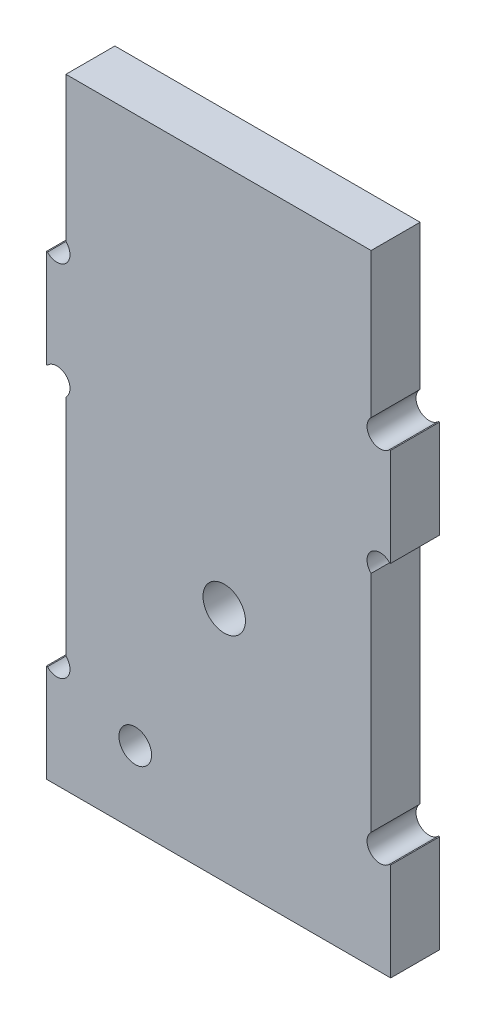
ISO-10303-21;
HEADER;
FILE_DESCRIPTION(('STEP AP214'),'2;1');
FILE_NAME('part.step','',(''),(''),'','','');
FILE_SCHEMA(('AUTOMOTIVE_DESIGN { 1 0 10303 214 1 1 1 1 }'));
ENDSEC;
DATA;
#1=APPLICATION_CONTEXT('core data for automotive mechanical design processes');
#2=APPLICATION_PROTOCOL_DEFINITION('international standard','automotive_design',2000,#1);
#3=PRODUCT_CONTEXT('',#1,'mechanical');
#4=PRODUCT('Part','Part','',(#3));
#5=PRODUCT_RELATED_PRODUCT_CATEGORY('part','',(#4));
#6=PRODUCT_DEFINITION_FORMATION('','',#4);
#7=PRODUCT_DEFINITION_CONTEXT('part definition',#1,'design');
#8=PRODUCT_DEFINITION('design','',#6,#7);
#9=PRODUCT_DEFINITION_SHAPE('','',#8);
#10=(LENGTH_UNIT() NAMED_UNIT(*) SI_UNIT(.MILLI.,.METRE.));
#11=(NAMED_UNIT(*) PLANE_ANGLE_UNIT() SI_UNIT($,.RADIAN.));
#12=(NAMED_UNIT(*) SI_UNIT($,.STERADIAN.) SOLID_ANGLE_UNIT());
#13=UNCERTAINTY_MEASURE_WITH_UNIT(LENGTH_MEASURE(1.E-05),#10,'distance_accuracy_value','');
#14=(GEOMETRIC_REPRESENTATION_CONTEXT(3) GLOBAL_UNCERTAINTY_ASSIGNED_CONTEXT((#13)) GLOBAL_UNIT_ASSIGNED_CONTEXT((#10,
#11,#12)) REPRESENTATION_CONTEXT('',''));
#15=CARTESIAN_POINT('',(0.,0.,0.));
#16=DIRECTION('',(0.,0.,1.));
#17=DIRECTION('',(1.,0.,0.));
#18=AXIS2_PLACEMENT_3D('',#15,#16,#17);
#19=CARTESIAN_POINT('',(-24.7,27.,6.));
#20=DIRECTION('',(0.,-1.,0.));
#21=DIRECTION('',(1.,0.,0.));
#22=AXIS2_PLACEMENT_3D('',#19,#20,#21);
#23=PLANE('',#22);
#24=DIRECTION('',(-1.,0.,0.));
#25=VECTOR('',#24,1.);
#26=CARTESIAN_POINT('',(-24.7,27.,0.));
#27=LINE('',#26,#25);
#28=CARTESIAN_POINT('',(-20.9618950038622,27.,0.));
#29=VERTEX_POINT('',#28);
#30=CARTESIAN_POINT('',(-21.1,27.,0.));
#31=VERTEX_POINT('',#30);
#32=EDGE_CURVE('E249',#29,#31,#27,.T.);
#33=ORIENTED_EDGE('',*,*,#32,.T.);
#34=DIRECTION('',(0.,0.,1.));
#35=VECTOR('',#34,1.);
#36=CARTESIAN_POINT('',(-21.1,27.,6.));
#37=LINE('',#36,#35);
#38=CARTESIAN_POINT('',(-21.1,27.,6.));
#39=VERTEX_POINT('',#38);
#40=EDGE_CURVE('E49',#31,#39,#37,.T.);
#41=ORIENTED_EDGE('',*,*,#40,.T.);
#42=DIRECTION('',(-1.,0.,0.));
#43=VECTOR('',#42,1.);
#44=CARTESIAN_POINT('',(-24.7,27.,6.));
#45=LINE('',#44,#43);
#46=CARTESIAN_POINT('',(-20.9618950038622,27.,6.));
#47=VERTEX_POINT('',#46);
#48=EDGE_CURVE('E220',#47,#39,#45,.T.);
#49=ORIENTED_EDGE('',*,*,#48,.F.);
#50=DIRECTION('',(0.,0.,1.));
#51=VECTOR('',#50,1.);
#52=CARTESIAN_POINT('',(-20.9618950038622,27.,0.));
#53=LINE('',#52,#51);
#54=EDGE_CURVE('E349',#47,#29,#53,.F.);
#55=ORIENTED_EDGE('',*,*,#54,.T.);
#56=EDGE_LOOP('',(#33,#41,#49,#55));
#57=FACE_BOUND('',#56,.T.);
#58=ADVANCED_FACE('F35',(#57),#23,.F.);
#59=CARTESIAN_POINT('',(-24.7,15.,6.));
#60=DIRECTION('',(0.,1.,0.));
#61=DIRECTION('',(0.,0.,1.));
#62=AXIS2_PLACEMENT_3D('',#59,#60,#61);
#63=PLANE('',#62);
#64=DIRECTION('',(1.,0.,0.));
#65=VECTOR('',#64,1.);
#66=CARTESIAN_POINT('',(-24.7,15.,6.));
#67=LINE('',#66,#65);
#68=CARTESIAN_POINT('',(-21.1,15.,6.));
#69=VERTEX_POINT('',#68);
#70=CARTESIAN_POINT('',(-20.9618950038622,15.,6.));
#71=VERTEX_POINT('',#70);
#72=EDGE_CURVE('E252',#69,#71,#67,.T.);
#73=ORIENTED_EDGE('',*,*,#72,.F.);
#74=DIRECTION('',(0.,0.,-1.));
#75=VECTOR('',#74,1.);
#76=CARTESIAN_POINT('',(-21.1,15.,6.));
#77=LINE('',#76,#75);
#78=CARTESIAN_POINT('',(-21.1,15.,0.));
#79=VERTEX_POINT('',#78);
#80=EDGE_CURVE('E316',#69,#79,#77,.T.);
#81=ORIENTED_EDGE('',*,*,#80,.T.);
#82=DIRECTION('',(1.,0.,0.));
#83=VECTOR('',#82,1.);
#84=CARTESIAN_POINT('',(-24.7,15.,0.));
#85=LINE('',#84,#83);
#86=CARTESIAN_POINT('',(-20.9618950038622,15.,0.));
#87=VERTEX_POINT('',#86);
#88=EDGE_CURVE('E224',#79,#87,#85,.T.);
#89=ORIENTED_EDGE('',*,*,#88,.T.);
#90=DIRECTION('',(0.,0.,-1.));
#91=VECTOR('',#90,1.);
#92=CARTESIAN_POINT('',(-20.9618950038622,15.,6.));
#93=LINE('',#92,#91);
#94=EDGE_CURVE('E273',#71,#87,#93,.T.);
#95=ORIENTED_EDGE('',*,*,#94,.F.);
#96=EDGE_LOOP('',(#73,#81,#89,#95));
#97=FACE_BOUND('',#96,.T.);
#98=ADVANCED_FACE('F37',(#97),#63,.F.);
#99=CARTESIAN_POINT('',(-19.8,13.9,6.));
#100=DIRECTION('',(0.,0.,-1.));
#101=DIRECTION('',(-1.,0.,0.));
#102=AXIS2_PLACEMENT_3D('',#99,#100,#101);
#103=CYLINDRICAL_SURFACE('',#102,1.60000000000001);
#104=CARTESIAN_POINT('',(-19.8,13.9,0.));
#105=DIRECTION('',(0.,0.,-1.));
#106=DIRECTION('',(-1.,0.,0.));
#107=AXIS2_PLACEMENT_3D('',#104,#105,#106);
#108=CIRCLE('',#107,1.60000000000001);
#109=CARTESIAN_POINT('',(-18.7,12.7381049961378,0.));
#110=VERTEX_POINT('',#109);
#111=EDGE_CURVE('E226',#87,#110,#108,.T.);
#112=ORIENTED_EDGE('',*,*,#111,.T.);
#113=DIRECTION('',(0.,0.,-1.));
#114=VECTOR('',#113,1.);
#115=CARTESIAN_POINT('',(-18.7,12.7381049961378,6.));
#116=LINE('',#115,#114);
#117=CARTESIAN_POINT('',(-18.7,12.7381049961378,6.));
#118=VERTEX_POINT('',#117);
#119=EDGE_CURVE('E270',#118,#110,#116,.T.);
#120=ORIENTED_EDGE('',*,*,#119,.F.);
#121=CARTESIAN_POINT('',(-19.8,13.9,6.));
#122=DIRECTION('',(0.,0.,-1.));
#123=DIRECTION('',(-1.,0.,0.));
#124=AXIS2_PLACEMENT_3D('',#121,#122,#123);
#125=CIRCLE('',#124,1.60000000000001);
#126=EDGE_CURVE('E374',#71,#118,#125,.T.);
#127=ORIENTED_EDGE('',*,*,#126,.F.);
#128=ORIENTED_EDGE('',*,*,#94,.T.);
#129=EDGE_LOOP('',(#112,#120,#127,#128));
#130=FACE_BOUND('',#129,.T.);
#131=ADVANCED_FACE('F443',(#130),#103,.F.);
#132=CARTESIAN_POINT('',(-18.7,12.7381049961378,6.));
#133=DIRECTION('',(1.,0.,0.));
#134=DIRECTION('',(0.,1.,0.));
#135=AXIS2_PLACEMENT_3D('',#132,#133,#134);
#136=PLANE('',#135);
#137=DIRECTION('',(0.,-1.,0.));
#138=VECTOR('',#137,1.);
#139=CARTESIAN_POINT('',(-18.7,12.7381049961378,0.));
#140=LINE('',#139,#138);
#141=CARTESIAN_POINT('',(-18.7,-14.7381049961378,0.));
#142=VERTEX_POINT('',#141);
#143=EDGE_CURVE('E229',#110,#142,#140,.T.);
#144=ORIENTED_EDGE('',*,*,#143,.T.);
#145=DIRECTION('',(0.,0.,-1.));
#146=VECTOR('',#145,1.);
#147=CARTESIAN_POINT('',(-18.7,-14.7381049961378,6.));
#148=LINE('',#147,#146);
#149=CARTESIAN_POINT('',(-18.7,-14.7381049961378,6.));
#150=VERTEX_POINT('',#149);
#151=EDGE_CURVE('E267',#150,#142,#148,.T.);
#152=ORIENTED_EDGE('',*,*,#151,.F.);
#153=DIRECTION('',(0.,-1.,0.));
#154=VECTOR('',#153,1.);
#155=CARTESIAN_POINT('',(-18.7,12.7381049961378,6.));
#156=LINE('',#155,#154);
#157=EDGE_CURVE('E376',#118,#150,#156,.T.);
#158=ORIENTED_EDGE('',*,*,#157,.F.);
#159=ORIENTED_EDGE('',*,*,#119,.T.);
#160=EDGE_LOOP('',(#144,#152,#158,#159));
#161=FACE_BOUND('',#160,.T.);
#162=ADVANCED_FACE('F593',(#161),#136,.F.);
#163=CARTESIAN_POINT('',(-19.8,-15.9,6.));
#164=DIRECTION('',(0.,0.,-1.));
#165=DIRECTION('',(-1.,0.,0.));
#166=AXIS2_PLACEMENT_3D('',#163,#164,#165);
#167=CYLINDRICAL_SURFACE('',#166,1.6);
#168=CARTESIAN_POINT('',(-19.8,-15.9,0.));
#169=DIRECTION('',(0.,0.,-1.));
#170=DIRECTION('',(-1.,0.,0.));
#171=AXIS2_PLACEMENT_3D('',#168,#169,#170);
#172=CIRCLE('',#171,1.6);
#173=CARTESIAN_POINT('',(-20.9618950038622,-17.,0.));
#174=VERTEX_POINT('',#173);
#175=EDGE_CURVE('E231',#142,#174,#172,.T.);
#176=ORIENTED_EDGE('',*,*,#175,.T.);
#177=DIRECTION('',(0.,0.,-1.));
#178=VECTOR('',#177,1.);
#179=CARTESIAN_POINT('',(-20.9618950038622,-17.,6.));
#180=LINE('',#179,#178);
#181=CARTESIAN_POINT('',(-20.9618950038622,-17.,6.));
#182=VERTEX_POINT('',#181);
#183=EDGE_CURVE('E264',#182,#174,#180,.T.);
#184=ORIENTED_EDGE('',*,*,#183,.F.);
#185=CARTESIAN_POINT('',(-19.8,-15.9,6.));
#186=DIRECTION('',(0.,0.,-1.));
#187=DIRECTION('',(-1.,0.,0.));
#188=AXIS2_PLACEMENT_3D('',#185,#186,#187);
#189=CIRCLE('',#188,1.6);
#190=EDGE_CURVE('E208',#150,#182,#189,.T.);
#191=ORIENTED_EDGE('',*,*,#190,.F.);
#192=ORIENTED_EDGE('',*,*,#151,.T.);
#193=EDGE_LOOP('',(#176,#184,#191,#192));
#194=FACE_BOUND('',#193,.T.);
#195=ADVANCED_FACE('F382',(#194),#167,.F.);
#196=CARTESIAN_POINT('',(-20.9618950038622,-17.,6.));
#197=DIRECTION('',(0.,-1.,0.));
#198=DIRECTION('',(1.,0.,0.));
#199=AXIS2_PLACEMENT_3D('',#196,#197,#198);
#200=PLANE('',#199);
#201=DIRECTION('',(-1.,0.,0.));
#202=VECTOR('',#201,1.);
#203=CARTESIAN_POINT('',(-20.9618950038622,-17.,0.));
#204=LINE('',#203,#202);
#205=CARTESIAN_POINT('',(-21.1,-17.,0.));
#206=VERTEX_POINT('',#205);
#207=EDGE_CURVE('E233',#174,#206,#204,.T.);
#208=ORIENTED_EDGE('',*,*,#207,.T.);
#209=DIRECTION('',(0.,0.,1.));
#210=VECTOR('',#209,1.);
#211=CARTESIAN_POINT('',(-21.1,-17.,6.));
#212=LINE('',#211,#210);
#213=CARTESIAN_POINT('',(-21.1,-17.,6.));
#214=VERTEX_POINT('',#213);
#215=EDGE_CURVE('E57',#206,#214,#212,.T.);
#216=ORIENTED_EDGE('',*,*,#215,.T.);
#217=DIRECTION('',(-1.,0.,0.));
#218=VECTOR('',#217,1.);
#219=CARTESIAN_POINT('',(-20.9618950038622,-17.,6.));
#220=LINE('',#219,#218);
#221=EDGE_CURVE('E197',#182,#214,#220,.T.);
#222=ORIENTED_EDGE('',*,*,#221,.F.);
#223=ORIENTED_EDGE('',*,*,#183,.T.);
#224=EDGE_LOOP('',(#208,#216,#222,#223));
#225=FACE_BOUND('',#224,.T.);
#226=ADVANCED_FACE('F386',(#225),#200,.F.);
#227=CARTESIAN_POINT('',(24.7,-29.,6.));
#228=DIRECTION('',(0.,1.,0.));
#229=DIRECTION('',(-1.,0.,0.));
#230=AXIS2_PLACEMENT_3D('',#227,#228,#229);
#231=PLANE('',#230);
#232=DIRECTION('',(1.,0.,0.));
#233=VECTOR('',#232,1.);
#234=CARTESIAN_POINT('',(24.7,-29.,6.));
#235=LINE('',#234,#233);
#236=CARTESIAN_POINT('',(-21.1,-29.,6.));
#237=VERTEX_POINT('',#236);
#238=CARTESIAN_POINT('',(21.1,-29.,6.));
#239=VERTEX_POINT('',#238);
#240=EDGE_CURVE('E194',#237,#239,#235,.T.);
#241=ORIENTED_EDGE('',*,*,#240,.F.);
#242=DIRECTION('',(0.,0.,-1.));
#243=VECTOR('',#242,1.);
#244=CARTESIAN_POINT('',(-21.1,-29.,6.));
#245=LINE('',#244,#243);
#246=CARTESIAN_POINT('',(-21.1,-29.,0.));
#247=VERTEX_POINT('',#246);
#248=EDGE_CURVE('E181',#237,#247,#245,.T.);
#249=ORIENTED_EDGE('',*,*,#248,.T.);
#250=DIRECTION('',(1.,0.,0.));
#251=VECTOR('',#250,1.);
#252=CARTESIAN_POINT('',(24.7,-29.,0.));
#253=LINE('',#252,#251);
#254=CARTESIAN_POINT('',(21.1,-29.,0.));
#255=VERTEX_POINT('',#254);
#256=EDGE_CURVE('E236',#247,#255,#253,.T.);
#257=ORIENTED_EDGE('',*,*,#256,.T.);
#258=DIRECTION('',(0.,0.,1.));
#259=VECTOR('',#258,1.);
#260=CARTESIAN_POINT('',(21.1,-29.,6.));
#261=LINE('',#260,#259);
#262=EDGE_CURVE('E203',#255,#239,#261,.T.);
#263=ORIENTED_EDGE('',*,*,#262,.T.);
#264=EDGE_LOOP('',(#241,#249,#257,#263));
#265=FACE_BOUND('',#264,.T.);
#266=ADVANCED_FACE('F201',(#265),#231,.F.);
#267=CARTESIAN_POINT('',(20.9618950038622,-17.,6.));
#268=DIRECTION('',(0.,-1.,0.));
#269=DIRECTION('',(0.,0.,-1.));
#270=AXIS2_PLACEMENT_3D('',#267,#268,#269);
#271=PLANE('',#270);
#272=DIRECTION('',(-1.,0.,0.));
#273=VECTOR('',#272,1.);
#274=CARTESIAN_POINT('',(20.9618950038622,-17.,6.));
#275=LINE('',#274,#273);
#276=CARTESIAN_POINT('',(21.1,-17.,6.));
#277=VERTEX_POINT('',#276);
#278=CARTESIAN_POINT('',(20.9618950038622,-17.,6.));
#279=VERTEX_POINT('',#278);
#280=EDGE_CURVE('E204',#277,#279,#275,.T.);
#281=ORIENTED_EDGE('',*,*,#280,.F.);
#282=DIRECTION('',(0.,0.,-1.));
#283=VECTOR('',#282,1.);
#284=CARTESIAN_POINT('',(21.1,-17.,6.));
#285=LINE('',#284,#283);
#286=CARTESIAN_POINT('',(21.1,-17.,0.));
#287=VERTEX_POINT('',#286);
#288=EDGE_CURVE('E288',#277,#287,#285,.T.);
#289=ORIENTED_EDGE('',*,*,#288,.T.);
#290=DIRECTION('',(-1.,0.,0.));
#291=VECTOR('',#290,1.);
#292=CARTESIAN_POINT('',(20.9618950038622,-17.,0.));
#293=LINE('',#292,#291);
#294=CARTESIAN_POINT('',(20.9618950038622,-17.,0.));
#295=VERTEX_POINT('',#294);
#296=EDGE_CURVE('E238',#287,#295,#293,.T.);
#297=ORIENTED_EDGE('',*,*,#296,.T.);
#298=DIRECTION('',(0.,0.,-1.));
#299=VECTOR('',#298,1.);
#300=CARTESIAN_POINT('',(20.9618950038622,-17.,6.));
#301=LINE('',#300,#299);
#302=EDGE_CURVE('E261',#279,#295,#301,.T.);
#303=ORIENTED_EDGE('',*,*,#302,.F.);
#304=EDGE_LOOP('',(#281,#289,#297,#303));
#305=FACE_BOUND('',#304,.T.);
#306=ADVANCED_FACE('F293',(#305),#271,.F.);
#307=CARTESIAN_POINT('',(19.8,-15.9,6.));
#308=DIRECTION('',(0.,0.,-1.));
#309=DIRECTION('',(-1.,0.,0.));
#310=AXIS2_PLACEMENT_3D('',#307,#308,#309);
#311=CYLINDRICAL_SURFACE('',#310,1.6);
#312=CARTESIAN_POINT('',(19.8,-15.9,0.));
#313=DIRECTION('',(0.,0.,-1.));
#314=DIRECTION('',(1.,0.,0.));
#315=AXIS2_PLACEMENT_3D('',#312,#313,#314);
#316=CIRCLE('',#315,1.6);
#317=CARTESIAN_POINT('',(18.7,-14.7381049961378,0.));
#318=VERTEX_POINT('',#317);
#319=EDGE_CURVE('E240',#295,#318,#316,.T.);
#320=ORIENTED_EDGE('',*,*,#319,.T.);
#321=DIRECTION('',(0.,0.,-1.));
#322=VECTOR('',#321,1.);
#323=CARTESIAN_POINT('',(18.7,-14.7381049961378,6.));
#324=LINE('',#323,#322);
#325=CARTESIAN_POINT('',(18.7,-14.7381049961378,6.));
#326=VERTEX_POINT('',#325);
#327=EDGE_CURVE('E258',#326,#318,#324,.T.);
#328=ORIENTED_EDGE('',*,*,#327,.F.);
#329=CARTESIAN_POINT('',(19.8,-15.9,6.));
#330=DIRECTION('',(0.,0.,-1.));
#331=DIRECTION('',(1.,0.,0.));
#332=AXIS2_PLACEMENT_3D('',#329,#330,#331);
#333=CIRCLE('',#332,1.6);
#334=EDGE_CURVE('E206',#279,#326,#333,.T.);
#335=ORIENTED_EDGE('',*,*,#334,.F.);
#336=ORIENTED_EDGE('',*,*,#302,.T.);
#337=EDGE_LOOP('',(#320,#328,#335,#336));
#338=FACE_BOUND('',#337,.T.);
#339=ADVANCED_FACE('F304',(#338),#311,.F.);
#340=CARTESIAN_POINT('',(18.7,12.7381049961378,6.));
#341=DIRECTION('',(-1.,0.,0.));
#342=DIRECTION('',(0.,-1.,0.));
#343=AXIS2_PLACEMENT_3D('',#340,#341,#342);
#344=PLANE('',#343);
#345=DIRECTION('',(0.,1.,0.));
#346=VECTOR('',#345,1.);
#347=CARTESIAN_POINT('',(18.7,12.7381049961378,0.));
#348=LINE('',#347,#346);
#349=CARTESIAN_POINT('',(18.7,12.7381049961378,0.));
#350=VERTEX_POINT('',#349);
#351=EDGE_CURVE('E242',#318,#350,#348,.T.);
#352=ORIENTED_EDGE('',*,*,#351,.T.);
#353=DIRECTION('',(0.,0.,-1.));
#354=VECTOR('',#353,1.);
#355=CARTESIAN_POINT('',(18.7,12.7381049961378,6.));
#356=LINE('',#355,#354);
#357=CARTESIAN_POINT('',(18.7,12.7381049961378,6.));
#358=VERTEX_POINT('',#357);
#359=EDGE_CURVE('E255',#358,#350,#356,.T.);
#360=ORIENTED_EDGE('',*,*,#359,.F.);
#361=DIRECTION('',(0.,1.,0.));
#362=VECTOR('',#361,1.);
#363=CARTESIAN_POINT('',(18.7,12.7381049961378,6.));
#364=LINE('',#363,#362);
#365=EDGE_CURVE('E213',#326,#358,#364,.T.);
#366=ORIENTED_EDGE('',*,*,#365,.F.);
#367=ORIENTED_EDGE('',*,*,#327,.T.);
#368=EDGE_LOOP('',(#352,#360,#366,#367));
#369=FACE_BOUND('',#368,.T.);
#370=ADVANCED_FACE('F308',(#369),#344,.F.);
#371=CARTESIAN_POINT('',(19.8,13.9,6.));
#372=DIRECTION('',(0.,0.,-1.));
#373=DIRECTION('',(-1.,0.,0.));
#374=AXIS2_PLACEMENT_3D('',#371,#372,#373);
#375=CYLINDRICAL_SURFACE('',#374,1.60000000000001);
#376=CARTESIAN_POINT('',(19.8,13.9,0.));
#377=DIRECTION('',(0.,0.,-1.));
#378=DIRECTION('',(1.,0.,0.));
#379=AXIS2_PLACEMENT_3D('',#376,#377,#378);
#380=CIRCLE('',#379,1.60000000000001);
#381=CARTESIAN_POINT('',(20.9618950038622,15.,0.));
#382=VERTEX_POINT('',#381);
#383=EDGE_CURVE('E244',#350,#382,#380,.T.);
#384=ORIENTED_EDGE('',*,*,#383,.T.);
#385=DIRECTION('',(0.,0.,-1.));
#386=VECTOR('',#385,1.);
#387=CARTESIAN_POINT('',(20.9618950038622,15.,6.));
#388=LINE('',#387,#386);
#389=CARTESIAN_POINT('',(20.9618950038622,15.,6.));
#390=VERTEX_POINT('',#389);
#391=EDGE_CURVE('E223',#390,#382,#388,.T.);
#392=ORIENTED_EDGE('',*,*,#391,.F.);
#393=CARTESIAN_POINT('',(19.8,13.9,6.));
#394=DIRECTION('',(0.,0.,-1.));
#395=DIRECTION('',(1.,0.,0.));
#396=AXIS2_PLACEMENT_3D('',#393,#394,#395);
#397=CIRCLE('',#396,1.60000000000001);
#398=EDGE_CURVE('E215',#358,#390,#397,.T.);
#399=ORIENTED_EDGE('',*,*,#398,.F.);
#400=ORIENTED_EDGE('',*,*,#359,.T.);
#401=EDGE_LOOP('',(#384,#392,#399,#400));
#402=FACE_BOUND('',#401,.T.);
#403=ADVANCED_FACE('F429',(#402),#375,.F.);
#404=CARTESIAN_POINT('',(24.7,15.,6.));
#405=DIRECTION('',(0.,1.,0.));
#406=DIRECTION('',(0.,0.,1.));
#407=AXIS2_PLACEMENT_3D('',#404,#405,#406);
#408=PLANE('',#407);
#409=DIRECTION('',(1.,0.,0.));
#410=VECTOR('',#409,1.);
#411=CARTESIAN_POINT('',(24.7,15.,0.));
#412=LINE('',#411,#410);
#413=CARTESIAN_POINT('',(21.1,15.,0.));
#414=VERTEX_POINT('',#413);
#415=EDGE_CURVE('E246',#382,#414,#412,.T.);
#416=ORIENTED_EDGE('',*,*,#415,.T.);
#417=DIRECTION('',(0.,0.,1.));
#418=VECTOR('',#417,1.);
#419=CARTESIAN_POINT('',(21.1,15.,6.));
#420=LINE('',#419,#418);
#421=CARTESIAN_POINT('',(21.1,15.,6.));
#422=VERTEX_POINT('',#421);
#423=EDGE_CURVE('E295',#414,#422,#420,.T.);
#424=ORIENTED_EDGE('',*,*,#423,.T.);
#425=DIRECTION('',(1.,0.,0.));
#426=VECTOR('',#425,1.);
#427=CARTESIAN_POINT('',(24.7,15.,6.));
#428=LINE('',#427,#426);
#429=EDGE_CURVE('E217',#390,#422,#428,.T.);
#430=ORIENTED_EDGE('',*,*,#429,.F.);
#431=ORIENTED_EDGE('',*,*,#391,.T.);
#432=EDGE_LOOP('',(#416,#424,#430,#431));
#433=FACE_BOUND('',#432,.T.);
#434=ADVANCED_FACE('F426',(#433),#408,.F.);
#435=CARTESIAN_POINT('',(21.1,27.,6.));
#436=VERTEX_POINT('',#435);
#437=CARTESIAN_POINT('',(20.9618950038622,27.,6.));
#438=VERTEX_POINT('',#437);
#439=EDGE_CURVE('E221',#436,#438,#45,.T.);
#440=ORIENTED_EDGE('',*,*,#439,.F.);
#441=DIRECTION('',(0.,0.,-1.));
#442=VECTOR('',#441,1.);
#443=CARTESIAN_POINT('',(21.1,27.,6.));
#444=LINE('',#443,#442);
#445=CARTESIAN_POINT('',(21.1,27.,0.));
#446=VERTEX_POINT('',#445);
#447=EDGE_CURVE('E315',#436,#446,#444,.T.);
#448=ORIENTED_EDGE('',*,*,#447,.T.);
#449=CARTESIAN_POINT('',(20.9618950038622,27.,0.));
#450=VERTEX_POINT('',#449);
#451=EDGE_CURVE('E250',#446,#450,#27,.T.);
#452=ORIENTED_EDGE('',*,*,#451,.T.);
#453=DIRECTION('',(0.,0.,1.));
#454=VECTOR('',#453,1.);
#455=CARTESIAN_POINT('',(20.9618950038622,27.,0.));
#456=LINE('',#455,#454);
#457=EDGE_CURVE('E340',#450,#438,#456,.T.);
#458=ORIENTED_EDGE('',*,*,#457,.T.);
#459=EDGE_LOOP('',(#440,#448,#452,#458));
#460=FACE_BOUND('',#459,.T.);
#461=ADVANCED_FACE('F421',(#460),#23,.F.);
#462=CARTESIAN_POINT('',(-19.8,13.9,6.));
#463=DIRECTION('',(0.,0.,-1.));
#464=DIRECTION('',(-1.,0.,0.));
#465=AXIS2_PLACEMENT_3D('',#462,#463,#464);
#466=PLANE('',#465);
#467=CARTESIAN_POINT('',(0.700000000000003,0.,6.));
#468=DIRECTION('',(0.,0.,1.));
#469=DIRECTION('',(1.,0.,0.));
#470=AXIS2_PLACEMENT_3D('',#467,#468,#469);
#471=CIRCLE('',#470,2.6);
#472=CARTESIAN_POINT('',(3.3,0.,6.));
#473=VERTEX_POINT('',#472);
#474=EDGE_CURVE('E324',#473,#473,#471,.T.);
#475=ORIENTED_EDGE('',*,*,#474,.F.);
#476=EDGE_LOOP('',(#475));
#477=FACE_BOUND('',#476,.T.);
#478=CARTESIAN_POINT('',(-10.2,-20.,6.));
#479=DIRECTION('',(0.,0.,1.));
#480=DIRECTION('',(1.,0.,0.));
#481=AXIS2_PLACEMENT_3D('',#478,#479,#480);
#482=CIRCLE('',#481,2.);
#483=CARTESIAN_POINT('',(-8.19999999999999,-20.,6.));
#484=VERTEX_POINT('',#483);
#485=EDGE_CURVE('E328',#484,#484,#482,.T.);
#486=ORIENTED_EDGE('',*,*,#485,.F.);
#487=EDGE_LOOP('',(#486));
#488=FACE_BOUND('',#487,.T.);
#489=ORIENTED_EDGE('',*,*,#48,.T.);
#490=DIRECTION('',(0.,1.,0.));
#491=VECTOR('',#490,1.);
#492=CARTESIAN_POINT('',(-21.1,40.9044304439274,6.));
#493=LINE('',#492,#491);
#494=EDGE_CURVE('E198',#69,#39,#493,.T.);
#495=ORIENTED_EDGE('',*,*,#494,.F.);
#496=ORIENTED_EDGE('',*,*,#72,.T.);
#497=ORIENTED_EDGE('',*,*,#126,.T.);
#498=ORIENTED_EDGE('',*,*,#157,.T.);
#499=ORIENTED_EDGE('',*,*,#190,.T.);
#500=ORIENTED_EDGE('',*,*,#221,.T.);
#501=EDGE_CURVE('E184',#237,#214,#493,.T.);
#502=ORIENTED_EDGE('',*,*,#501,.F.);
#503=ORIENTED_EDGE('',*,*,#240,.T.);
#504=DIRECTION('',(0.,-1.,0.));
#505=VECTOR('',#504,1.);
#506=CARTESIAN_POINT('',(21.1,40.9044304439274,6.));
#507=LINE('',#506,#505);
#508=EDGE_CURVE('E312',#277,#239,#507,.T.);
#509=ORIENTED_EDGE('',*,*,#508,.F.);
#510=ORIENTED_EDGE('',*,*,#280,.T.);
#511=ORIENTED_EDGE('',*,*,#334,.T.);
#512=ORIENTED_EDGE('',*,*,#365,.T.);
#513=ORIENTED_EDGE('',*,*,#398,.T.);
#514=ORIENTED_EDGE('',*,*,#429,.T.);
#515=EDGE_CURVE('E313',#436,#422,#507,.T.);
#516=ORIENTED_EDGE('',*,*,#515,.F.);
#517=ORIENTED_EDGE('',*,*,#439,.T.);
#518=CARTESIAN_POINT('',(19.8,28.1,6.));
#519=DIRECTION('',(0.,0.,1.));
#520=DIRECTION('',(-1.,0.,0.));
#521=AXIS2_PLACEMENT_3D('',#518,#519,#520);
#522=CIRCLE('',#521,1.6);
#523=CARTESIAN_POINT('',(18.7,29.2618950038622,6.));
#524=VERTEX_POINT('',#523);
#525=EDGE_CURVE('E334',#524,#438,#522,.T.);
#526=ORIENTED_EDGE('',*,*,#525,.F.);
#527=DIRECTION('',(0.,1.,0.));
#528=VECTOR('',#527,1.);
#529=CARTESIAN_POINT('',(18.7,47.,6.));
#530=LINE('',#529,#528);
#531=CARTESIAN_POINT('',(18.7,47.,6.));
#532=VERTEX_POINT('',#531);
#533=EDGE_CURVE('E366',#524,#532,#530,.T.);
#534=ORIENTED_EDGE('',*,*,#533,.T.);
#535=DIRECTION('',(-1.,0.,0.));
#536=VECTOR('',#535,1.);
#537=CARTESIAN_POINT('',(-18.7,47.,6.));
#538=LINE('',#537,#536);
#539=CARTESIAN_POINT('',(-18.7,47.,6.));
#540=VERTEX_POINT('',#539);
#541=EDGE_CURVE('E358',#532,#540,#538,.T.);
#542=ORIENTED_EDGE('',*,*,#541,.T.);
#543=DIRECTION('',(0.,-1.,0.));
#544=VECTOR('',#543,1.);
#545=CARTESIAN_POINT('',(-18.7,47.,6.));
#546=LINE('',#545,#544);
#547=CARTESIAN_POINT('',(-18.7,29.2618950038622,6.));
#548=VERTEX_POINT('',#547);
#549=EDGE_CURVE('E353',#540,#548,#546,.T.);
#550=ORIENTED_EDGE('',*,*,#549,.T.);
#551=CARTESIAN_POINT('',(-19.8,28.1,6.));
#552=DIRECTION('',(0.,0.,1.));
#553=DIRECTION('',(1.,0.,0.));
#554=AXIS2_PLACEMENT_3D('',#551,#552,#553);
#555=CIRCLE('',#554,1.6);
#556=EDGE_CURVE('E345',#47,#548,#555,.T.);
#557=ORIENTED_EDGE('',*,*,#556,.F.);
#558=EDGE_LOOP('',(#489,#495,#496,#497,#498,#499,#500,#502,#503,#509,#510,#511,#512,#513,#514,
#516,#517,#526,#534,#542,#550,#557));
#559=FACE_BOUND('',#558,.T.);
#560=ADVANCED_FACE('F192',(#477,#488,#559),#466,.F.);
#561=CARTESIAN_POINT('',(-19.8,13.9,0.));
#562=DIRECTION('',(0.,0.,-1.));
#563=DIRECTION('',(-1.,0.,0.));
#564=AXIS2_PLACEMENT_3D('',#561,#562,#563);
#565=PLANE('',#564);
#566=DIRECTION('',(0.,-1.,0.));
#567=VECTOR('',#566,1.);
#568=CARTESIAN_POINT('',(-21.1,13.9,0.));
#569=LINE('',#568,#567);
#570=EDGE_CURVE('E11',#31,#79,#569,.T.);
#571=ORIENTED_EDGE('',*,*,#570,.F.);
#572=ORIENTED_EDGE('',*,*,#32,.F.);
#573=CARTESIAN_POINT('',(-19.8,28.1,0.));
#574=DIRECTION('',(0.,0.,1.));
#575=DIRECTION('',(1.,0.,0.));
#576=AXIS2_PLACEMENT_3D('',#573,#574,#575);
#577=CIRCLE('',#576,1.6);
#578=CARTESIAN_POINT('',(-18.7,29.2618950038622,0.));
#579=VERTEX_POINT('',#578);
#580=EDGE_CURVE('E346',#29,#579,#577,.T.);
#581=ORIENTED_EDGE('',*,*,#580,.T.);
#582=DIRECTION('',(0.,-1.,0.));
#583=VECTOR('',#582,1.);
#584=CARTESIAN_POINT('',(-18.7,47.,0.));
#585=LINE('',#584,#583);
#586=CARTESIAN_POINT('',(-18.7,47.,0.));
#587=VERTEX_POINT('',#586);
#588=EDGE_CURVE('E354',#587,#579,#585,.T.);
#589=ORIENTED_EDGE('',*,*,#588,.F.);
#590=DIRECTION('',(-1.,0.,0.));
#591=VECTOR('',#590,1.);
#592=CARTESIAN_POINT('',(-18.7,47.,0.));
#593=LINE('',#592,#591);
#594=CARTESIAN_POINT('',(18.7,47.,0.));
#595=VERTEX_POINT('',#594);
#596=EDGE_CURVE('E360',#595,#587,#593,.T.);
#597=ORIENTED_EDGE('',*,*,#596,.F.);
#598=DIRECTION('',(0.,1.,0.));
#599=VECTOR('',#598,1.);
#600=CARTESIAN_POINT('',(18.7,47.,0.));
#601=LINE('',#600,#599);
#602=CARTESIAN_POINT('',(18.7,29.2618950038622,0.));
#603=VERTEX_POINT('',#602);
#604=EDGE_CURVE('E357',#603,#595,#601,.T.);
#605=ORIENTED_EDGE('',*,*,#604,.F.);
#606=CARTESIAN_POINT('',(19.8,28.1,0.));
#607=DIRECTION('',(0.,0.,1.));
#608=DIRECTION('',(-1.,0.,0.));
#609=AXIS2_PLACEMENT_3D('',#606,#607,#608);
#610=CIRCLE('',#609,1.6);
#611=EDGE_CURVE('E337',#603,#450,#610,.T.);
#612=ORIENTED_EDGE('',*,*,#611,.T.);
#613=ORIENTED_EDGE('',*,*,#451,.F.);
#614=DIRECTION('',(0.,1.,0.));
#615=VECTOR('',#614,1.);
#616=CARTESIAN_POINT('',(21.1,13.9,0.));
#617=LINE('',#616,#615);
#618=EDGE_CURVE('E279',#414,#446,#617,.T.);
#619=ORIENTED_EDGE('',*,*,#618,.F.);
#620=ORIENTED_EDGE('',*,*,#415,.F.);
#621=ORIENTED_EDGE('',*,*,#383,.F.);
#622=ORIENTED_EDGE('',*,*,#351,.F.);
#623=ORIENTED_EDGE('',*,*,#319,.F.);
#624=ORIENTED_EDGE('',*,*,#296,.F.);
#625=EDGE_CURVE('E280',#255,#287,#617,.T.);
#626=ORIENTED_EDGE('',*,*,#625,.F.);
#627=ORIENTED_EDGE('',*,*,#256,.F.);
#628=EDGE_CURVE('E39',#206,#247,#569,.T.);
#629=ORIENTED_EDGE('',*,*,#628,.F.);
#630=ORIENTED_EDGE('',*,*,#207,.F.);
#631=ORIENTED_EDGE('',*,*,#175,.F.);
#632=ORIENTED_EDGE('',*,*,#143,.F.);
#633=ORIENTED_EDGE('',*,*,#111,.F.);
#634=ORIENTED_EDGE('',*,*,#88,.F.);
#635=EDGE_LOOP('',(#571,#572,#581,#589,#597,#605,#612,#613,#619,#620,#621,#622,#623,#624,#626,
#627,#629,#630,#631,#632,#633,#634));
#636=FACE_BOUND('',#635,.T.);
#637=CARTESIAN_POINT('',(0.700000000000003,0.,0.));
#638=DIRECTION('',(0.,0.,1.));
#639=DIRECTION('',(1.,0.,0.));
#640=AXIS2_PLACEMENT_3D('',#637,#638,#639);
#641=CIRCLE('',#640,2.6);
#642=CARTESIAN_POINT('',(3.3,0.,0.));
#643=VERTEX_POINT('',#642);
#644=EDGE_CURVE('E325',#643,#643,#641,.T.);
#645=ORIENTED_EDGE('',*,*,#644,.T.);
#646=EDGE_LOOP('',(#645));
#647=FACE_BOUND('',#646,.T.);
#648=CARTESIAN_POINT('',(-10.2,-20.,0.));
#649=DIRECTION('',(0.,0.,1.));
#650=DIRECTION('',(1.,0.,0.));
#651=AXIS2_PLACEMENT_3D('',#648,#649,#650);
#652=CIRCLE('',#651,2.);
#653=CARTESIAN_POINT('',(-8.19999999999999,-20.,0.));
#654=VERTEX_POINT('',#653);
#655=EDGE_CURVE('E331',#654,#654,#652,.T.);
#656=ORIENTED_EDGE('',*,*,#655,.T.);
#657=EDGE_LOOP('',(#656));
#658=FACE_BOUND('',#657,.T.);
#659=ADVANCED_FACE('F298',(#636,#647,#658),#565,.T.);
#660=CARTESIAN_POINT('',(-18.7,47.,0.));
#661=DIRECTION('',(-1.,0.,0.));
#662=DIRECTION('',(0.,-1.,0.));
#663=AXIS2_PLACEMENT_3D('',#660,#661,#662);
#664=PLANE('',#663);
#665=DIRECTION('',(0.,0.,1.));
#666=VECTOR('',#665,1.);
#667=CARTESIAN_POINT('',(-18.7,29.2618950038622,0.));
#668=LINE('',#667,#666);
#669=EDGE_CURVE('E276',#548,#579,#668,.F.);
#670=ORIENTED_EDGE('',*,*,#669,.F.);
#671=ORIENTED_EDGE('',*,*,#549,.F.);
#672=DIRECTION('',(0.,0.,1.));
#673=VECTOR('',#672,1.);
#674=CARTESIAN_POINT('',(-18.7,47.,0.));
#675=LINE('',#674,#673);
#676=EDGE_CURVE('E227',#587,#540,#675,.T.);
#677=ORIENTED_EDGE('',*,*,#676,.F.);
#678=ORIENTED_EDGE('',*,*,#588,.T.);
#679=EDGE_LOOP('',(#670,#671,#677,#678));
#680=FACE_BOUND('',#679,.T.);
#681=ADVANCED_FACE('F402',(#680),#664,.T.);
#682=CARTESIAN_POINT('',(18.7,47.,0.));
#683=DIRECTION('',(1.,0.,0.));
#684=DIRECTION('',(0.,0.,-1.));
#685=AXIS2_PLACEMENT_3D('',#682,#683,#684);
#686=PLANE('',#685);
#687=DIRECTION('',(0.,0.,1.));
#688=VECTOR('',#687,1.);
#689=CARTESIAN_POINT('',(18.7,29.2618950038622,0.));
#690=LINE('',#689,#688);
#691=EDGE_CURVE('E278',#603,#524,#690,.T.);
#692=ORIENTED_EDGE('',*,*,#691,.F.);
#693=ORIENTED_EDGE('',*,*,#604,.T.);
#694=DIRECTION('',(0.,0.,1.));
#695=VECTOR('',#694,1.);
#696=CARTESIAN_POINT('',(18.7,47.,0.));
#697=LINE('',#696,#695);
#698=EDGE_CURVE('E363',#595,#532,#697,.T.);
#699=ORIENTED_EDGE('',*,*,#698,.T.);
#700=ORIENTED_EDGE('',*,*,#533,.F.);
#701=EDGE_LOOP('',(#692,#693,#699,#700));
#702=FACE_BOUND('',#701,.T.);
#703=ADVANCED_FACE('F413',(#702),#686,.T.);
#704=CARTESIAN_POINT('',(-18.7,47.,0.));
#705=DIRECTION('',(0.,1.,0.));
#706=DIRECTION('',(0.,0.,1.));
#707=AXIS2_PLACEMENT_3D('',#704,#705,#706);
#708=PLANE('',#707);
#709=ORIENTED_EDGE('',*,*,#541,.F.);
#710=ORIENTED_EDGE('',*,*,#698,.F.);
#711=ORIENTED_EDGE('',*,*,#596,.T.);
#712=ORIENTED_EDGE('',*,*,#676,.T.);
#713=EDGE_LOOP('',(#709,#710,#711,#712));
#714=FACE_BOUND('',#713,.T.);
#715=ADVANCED_FACE('F409',(#714),#708,.T.);
#716=CARTESIAN_POINT('',(-19.8,28.1,0.));
#717=DIRECTION('',(0.,0.,1.));
#718=DIRECTION('',(1.,0.,0.));
#719=AXIS2_PLACEMENT_3D('',#716,#717,#718);
#720=CYLINDRICAL_SURFACE('',#719,1.6);
#721=ORIENTED_EDGE('',*,*,#556,.T.);
#722=ORIENTED_EDGE('',*,*,#669,.T.);
#723=ORIENTED_EDGE('',*,*,#580,.F.);
#724=ORIENTED_EDGE('',*,*,#54,.F.);
#725=EDGE_LOOP('',(#721,#722,#723,#724));
#726=FACE_BOUND('',#725,.T.);
#727=ADVANCED_FACE('F400',(#726),#720,.F.);
#728=CARTESIAN_POINT('',(19.8,28.1,0.));
#729=DIRECTION('',(0.,0.,1.));
#730=DIRECTION('',(1.,0.,0.));
#731=AXIS2_PLACEMENT_3D('',#728,#729,#730);
#732=CYLINDRICAL_SURFACE('',#731,1.6);
#733=ORIENTED_EDGE('',*,*,#611,.F.);
#734=ORIENTED_EDGE('',*,*,#691,.T.);
#735=ORIENTED_EDGE('',*,*,#525,.T.);
#736=ORIENTED_EDGE('',*,*,#457,.F.);
#737=EDGE_LOOP('',(#733,#734,#735,#736));
#738=FACE_BOUND('',#737,.T.);
#739=ADVANCED_FACE('F417',(#738),#732,.F.);
#740=CARTESIAN_POINT('',(-10.2,-20.,0.));
#741=DIRECTION('',(0.,0.,1.));
#742=DIRECTION('',(1.,0.,0.));
#743=AXIS2_PLACEMENT_3D('',#740,#741,#742);
#744=CYLINDRICAL_SURFACE('',#743,2.);
#745=ORIENTED_EDGE('',*,*,#655,.F.);
#746=EDGE_LOOP('',(#745));
#747=FACE_BOUND('',#746,.T.);
#748=ORIENTED_EDGE('',*,*,#485,.T.);
#749=EDGE_LOOP('',(#748));
#750=FACE_BOUND('',#749,.T.);
#751=ADVANCED_FACE('F468',(#747,#750),#744,.F.);
#752=CARTESIAN_POINT('',(0.700000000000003,0.,0.));
#753=DIRECTION('',(0.,0.,1.));
#754=DIRECTION('',(1.,0.,0.));
#755=AXIS2_PLACEMENT_3D('',#752,#753,#754);
#756=CYLINDRICAL_SURFACE('',#755,2.6);
#757=ORIENTED_EDGE('',*,*,#644,.F.);
#758=EDGE_LOOP('',(#757));
#759=FACE_BOUND('',#758,.T.);
#760=ORIENTED_EDGE('',*,*,#474,.T.);
#761=EDGE_LOOP('',(#760));
#762=FACE_BOUND('',#761,.T.);
#763=ADVANCED_FACE('F471',(#759,#762),#756,.F.);
#764=CARTESIAN_POINT('',(21.1,40.9044304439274,-4.));
#765=DIRECTION('',(-1.,0.,0.));
#766=DIRECTION('',(0.,-1.,0.));
#767=AXIS2_PLACEMENT_3D('',#764,#765,#766);
#768=PLANE('',#767);
#769=ORIENTED_EDGE('',*,*,#618,.T.);
#770=ORIENTED_EDGE('',*,*,#447,.F.);
#771=ORIENTED_EDGE('',*,*,#515,.T.);
#772=ORIENTED_EDGE('',*,*,#423,.F.);
#773=EDGE_LOOP('',(#769,#770,#771,#772));
#774=FACE_BOUND('',#773,.T.);
#775=ADVANCED_FACE('F423',(#774),#768,.F.);
#776=ORIENTED_EDGE('',*,*,#625,.T.);
#777=ORIENTED_EDGE('',*,*,#288,.F.);
#778=ORIENTED_EDGE('',*,*,#508,.T.);
#779=ORIENTED_EDGE('',*,*,#262,.F.);
#780=EDGE_LOOP('',(#776,#777,#778,#779));
#781=FACE_BOUND('',#780,.T.);
#782=ADVANCED_FACE('F287',(#781),#768,.F.);
#783=CARTESIAN_POINT('',(-21.1,40.9044304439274,-4.));
#784=DIRECTION('',(1.,0.,0.));
#785=DIRECTION('',(0.,1.,0.));
#786=AXIS2_PLACEMENT_3D('',#783,#784,#785);
#787=PLANE('',#786);
#788=ORIENTED_EDGE('',*,*,#628,.T.);
#789=ORIENTED_EDGE('',*,*,#248,.F.);
#790=ORIENTED_EDGE('',*,*,#501,.T.);
#791=ORIENTED_EDGE('',*,*,#215,.F.);
#792=EDGE_LOOP('',(#788,#789,#790,#791));
#793=FACE_BOUND('',#792,.T.);
#794=ADVANCED_FACE('F183',(#793),#787,.F.);
#795=ORIENTED_EDGE('',*,*,#570,.T.);
#796=ORIENTED_EDGE('',*,*,#80,.F.);
#797=ORIENTED_EDGE('',*,*,#494,.T.);
#798=ORIENTED_EDGE('',*,*,#40,.F.);
#799=EDGE_LOOP('',(#795,#796,#797,#798));
#800=FACE_BOUND('',#799,.T.);
#801=ADVANCED_FACE('F390',(#800),#787,.F.);
#802=CLOSED_SHELL('',(#58,#98,#131,#162,#195,#226,#266,#306,#339,#370,#403,#434,#461,#560,#659,
#681,#703,#715,#727,#739,#751,#763,#775,#782,#794,#801));
#803=MANIFOLD_SOLID_BREP('B2',#802);
#804=ADVANCED_BREP_SHAPE_REPRESENTATION('',(#18,#803),#14);
#805=SHAPE_DEFINITION_REPRESENTATION(#9,#804);
ENDSEC;
END-ISO-10303-21;
